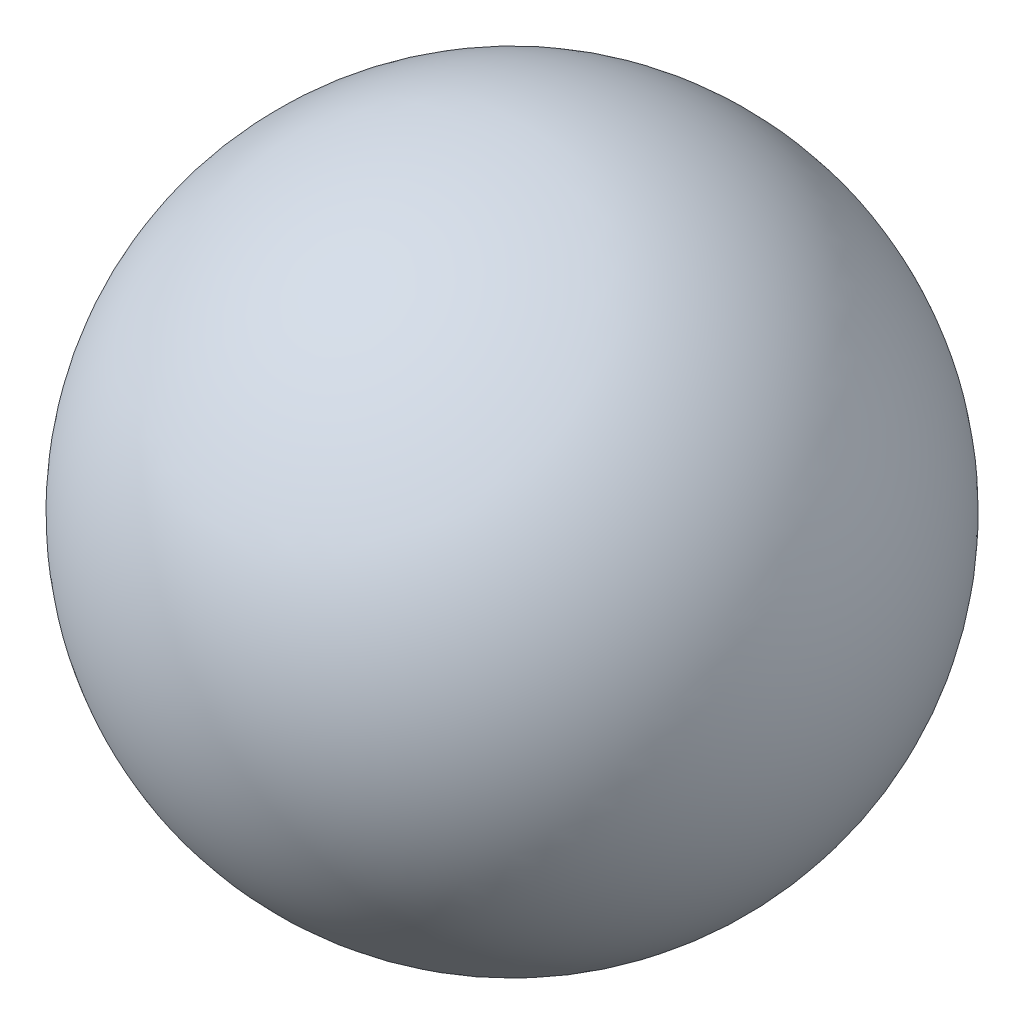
from build123d import *


with BuildPart() as part:
    # Sketch1 → Revolve1 (revolve)
    with BuildSketch(Plane(origin=(0, 0, 0), x_dir=(1, 0, 0), z_dir=(0, 1, 0))):
        with BuildLine():
            Line((0, -14.740488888), (0, 14.740488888))
            ThreePointArc((0, 14.740488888), (-14.740488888, 0), (0, -14.740488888))
        make_face()
    revolve(axis=Axis((0, 0, 14.740488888), (0, 0, -1)))


solid = part.part
